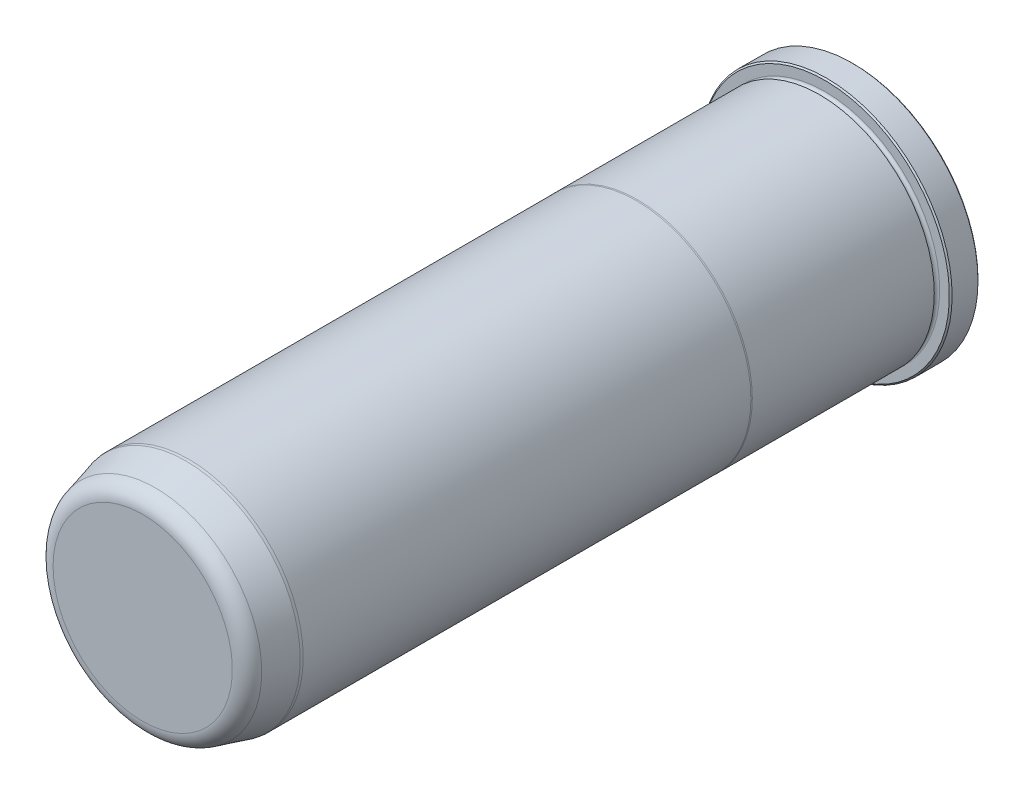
ISO-10303-21;
HEADER;
FILE_DESCRIPTION(('STEP AP214'),'2;1');
FILE_NAME('part.step','',(''),(''),'','','');
FILE_SCHEMA(('AUTOMOTIVE_DESIGN { 1 0 10303 214 1 1 1 1 }'));
ENDSEC;
DATA;
#1=APPLICATION_CONTEXT('core data for automotive mechanical design processes');
#2=APPLICATION_PROTOCOL_DEFINITION('international standard','automotive_design',2000,#1);
#3=PRODUCT_CONTEXT('',#1,'mechanical');
#4=PRODUCT('Part','Part','',(#3));
#5=PRODUCT_RELATED_PRODUCT_CATEGORY('part','',(#4));
#6=PRODUCT_DEFINITION_FORMATION('','',#4);
#7=PRODUCT_DEFINITION_CONTEXT('part definition',#1,'design');
#8=PRODUCT_DEFINITION('design','',#6,#7);
#9=PRODUCT_DEFINITION_SHAPE('','',#8);
#10=(LENGTH_UNIT() NAMED_UNIT(*) SI_UNIT(.MILLI.,.METRE.));
#11=(NAMED_UNIT(*) PLANE_ANGLE_UNIT() SI_UNIT($,.RADIAN.));
#12=(NAMED_UNIT(*) SI_UNIT($,.STERADIAN.) SOLID_ANGLE_UNIT());
#13=UNCERTAINTY_MEASURE_WITH_UNIT(LENGTH_MEASURE(1.E-05),#10,'distance_accuracy_value','');
#14=(GEOMETRIC_REPRESENTATION_CONTEXT(3) GLOBAL_UNCERTAINTY_ASSIGNED_CONTEXT((#13)) GLOBAL_UNIT_ASSIGNED_CONTEXT((#10,
#11,#12)) REPRESENTATION_CONTEXT('',''));
#15=CARTESIAN_POINT('',(0.,0.,0.));
#16=DIRECTION('',(0.,0.,1.));
#17=DIRECTION('',(1.,0.,0.));
#18=AXIS2_PLACEMENT_3D('',#15,#16,#17);
#19=CARTESIAN_POINT('',(0.,0.,0.));
#20=DIRECTION('',(0.,0.,1.));
#21=DIRECTION('',(1.,0.,0.));
#22=AXIS2_PLACEMENT_3D('',#19,#20,#21);
#23=PLANE('',#22);
#24=CARTESIAN_POINT('',(0.,0.,0.));
#25=DIRECTION('',(0.,0.,1.));
#26=DIRECTION('',(1.,0.,0.));
#27=AXIS2_PLACEMENT_3D('',#24,#25,#26);
#28=CIRCLE('',#27,34.417);
#29=CARTESIAN_POINT('',(34.417,0.,0.));
#30=VERTEX_POINT('',#29);
#31=EDGE_CURVE('E37',#30,#30,#28,.F.);
#32=ORIENTED_EDGE('',*,*,#31,.T.);
#33=EDGE_LOOP('',(#32));
#34=FACE_BOUND('',#33,.T.);
#35=ADVANCED_FACE('F30',(#34),#23,.F.);
#36=CARTESIAN_POINT('',(0.,0.,0.));
#37=DIRECTION('',(0.,0.,1.));
#38=DIRECTION('',(1.,0.,0.));
#39=AXIS2_PLACEMENT_3D('',#36,#37,#38);
#40=CYLINDRICAL_SURFACE('',#39,34.798);
#41=CARTESIAN_POINT('',(0.,0.,0.380999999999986));
#42=DIRECTION('',(0.,0.,1.));
#43=DIRECTION('',(1.,0.,0.));
#44=AXIS2_PLACEMENT_3D('',#41,#42,#43);
#45=CIRCLE('',#44,34.798);
#46=CARTESIAN_POINT('',(34.798,0.,0.380999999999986));
#47=VERTEX_POINT('',#46);
#48=EDGE_CURVE('E41',#47,#47,#45,.T.);
#49=ORIENTED_EDGE('',*,*,#48,.T.);
#50=EDGE_LOOP('',(#49));
#51=FACE_BOUND('',#50,.T.);
#52=CARTESIAN_POINT('',(0.,0.,7.5438));
#53=DIRECTION('',(0.,0.,-1.));
#54=DIRECTION('',(-1.,0.,0.));
#55=AXIS2_PLACEMENT_3D('',#52,#53,#54);
#56=CIRCLE('',#55,34.798);
#57=CARTESIAN_POINT('',(-34.798,0.,7.5438));
#58=VERTEX_POINT('',#57);
#59=EDGE_CURVE('E45',#58,#58,#56,.T.);
#60=ORIENTED_EDGE('',*,*,#59,.T.);
#61=EDGE_LOOP('',(#60));
#62=FACE_BOUND('',#61,.T.);
#63=ADVANCED_FACE('F118',(#51,#62),#40,.T.);
#64=CARTESIAN_POINT('',(0.,34.798,7.9248));
#65=DIRECTION('',(0.,0.,-1.));
#66=DIRECTION('',(-1.,0.,0.));
#67=AXIS2_PLACEMENT_3D('',#64,#65,#66);
#68=PLANE('',#67);
#69=CARTESIAN_POINT('',(0.,0.,7.9248));
#70=DIRECTION('',(0.,0.,-1.));
#71=DIRECTION('',(-1.,0.,0.));
#72=AXIS2_PLACEMENT_3D('',#69,#70,#71);
#73=CIRCLE('',#72,34.417);
#74=CARTESIAN_POINT('',(-34.417,0.,7.9248));
#75=VERTEX_POINT('',#74);
#76=EDGE_CURVE('E10',#75,#75,#73,.F.);
#77=ORIENTED_EDGE('',*,*,#76,.T.);
#78=EDGE_LOOP('',(#77));
#79=FACE_BOUND('',#78,.T.);
#80=CARTESIAN_POINT('',(0.,0.,7.9248));
#81=DIRECTION('',(0.,0.,1.));
#82=DIRECTION('',(1.,0.,0.));
#83=AXIS2_PLACEMENT_3D('',#80,#81,#82);
#84=CIRCLE('',#83,31.7373);
#85=CARTESIAN_POINT('',(31.7373,0.,7.9248));
#86=VERTEX_POINT('',#85);
#87=EDGE_CURVE('E56',#86,#86,#84,.T.);
#88=ORIENTED_EDGE('',*,*,#87,.F.);
#89=EDGE_LOOP('',(#88));
#90=FACE_BOUND('',#89,.T.);
#91=ADVANCED_FACE('F113',(#79,#90),#68,.F.);
#92=CARTESIAN_POINT('',(0.,0.,8.6868));
#93=DIRECTION('',(0.,0.,1.));
#94=DIRECTION('',(1.,0.,0.));
#95=AXIS2_PLACEMENT_3D('',#92,#93,#94);
#96=TOROIDAL_SURFACE('',#95,31.7373,0.761999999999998);
#97=CARTESIAN_POINT('',(0.,0.,9.44879999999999));
#98=DIRECTION('',(0.,0.,1.));
#99=DIRECTION('',(1.,0.,0.));
#100=AXIS2_PLACEMENT_3D('',#97,#98,#99);
#101=CIRCLE('',#100,31.7373);
#102=CARTESIAN_POINT('',(31.7373,0.,9.44879999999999));
#103=VERTEX_POINT('',#102);
#104=EDGE_CURVE('E59',#103,#103,#101,.T.);
#105=ORIENTED_EDGE('',*,*,#104,.F.);
#106=EDGE_LOOP('',(#105));
#107=FACE_BOUND('',#106,.T.);
#108=ORIENTED_EDGE('',*,*,#87,.T.);
#109=EDGE_LOOP('',(#108));
#110=FACE_BOUND('',#109,.T.);
#111=ADVANCED_FACE('F107',(#107,#110),#96,.F.);
#112=CARTESIAN_POINT('',(0.,31.7373,9.44879999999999));
#113=DIRECTION('',(0.,0.,1.));
#114=DIRECTION('',(1.,0.,0.));
#115=AXIS2_PLACEMENT_3D('',#112,#113,#114);
#116=PLANE('',#115);
#117=CARTESIAN_POINT('',(0.,0.,9.4488));
#118=DIRECTION('',(0.,0.,1.));
#119=DIRECTION('',(1.,0.,0.));
#120=AXIS2_PLACEMENT_3D('',#117,#118,#119);
#121=CIRCLE('',#120,31.7627);
#122=CARTESIAN_POINT('',(31.7627,0.,9.4488));
#123=VERTEX_POINT('',#122);
#124=EDGE_CURVE('E62',#123,#123,#121,.T.);
#125=ORIENTED_EDGE('',*,*,#124,.F.);
#126=EDGE_LOOP('',(#125));
#127=FACE_BOUND('',#126,.T.);
#128=ORIENTED_EDGE('',*,*,#104,.T.);
#129=EDGE_LOOP('',(#128));
#130=FACE_BOUND('',#129,.T.);
#131=ADVANCED_FACE('F101',(#127,#130),#116,.F.);
#132=CARTESIAN_POINT('',(0.,0.,0.));
#133=DIRECTION('',(0.,0.,1.));
#134=DIRECTION('',(1.,0.,0.));
#135=AXIS2_PLACEMENT_3D('',#132,#133,#134);
#136=CYLINDRICAL_SURFACE('',#135,31.7627);
#137=CARTESIAN_POINT('',(0.,0.,59.8347630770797));
#138=DIRECTION('',(0.,0.,1.));
#139=DIRECTION('',(1.,0.,0.));
#140=AXIS2_PLACEMENT_3D('',#137,#138,#139);
#141=CIRCLE('',#140,31.7627);
#142=CARTESIAN_POINT('',(31.7627,0.,59.8347630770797));
#143=VERTEX_POINT('',#142);
#144=EDGE_CURVE('E65',#143,#143,#141,.T.);
#145=ORIENTED_EDGE('',*,*,#144,.F.);
#146=EDGE_LOOP('',(#145));
#147=FACE_BOUND('',#146,.T.);
#148=ORIENTED_EDGE('',*,*,#124,.T.);
#149=EDGE_LOOP('',(#148));
#150=FACE_BOUND('',#149,.T.);
#151=ADVANCED_FACE('F95',(#147,#150),#136,.T.);
#152=CARTESIAN_POINT('',(0.,0.,59.8347630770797));
#153=DIRECTION('',(0.,0.,-1.));
#154=DIRECTION('',(-1.,0.,0.));
#155=AXIS2_PLACEMENT_3D('',#152,#153,#154);
#156=CONICAL_SURFACE('',#155,31.7627,0.0698131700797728);
#157=CARTESIAN_POINT('',(0.,0.,60.198));
#158=DIRECTION('',(0.,0.,1.));
#159=DIRECTION('',(1.,0.,0.));
#160=AXIS2_PLACEMENT_3D('',#157,#158,#159);
#161=CIRCLE('',#160,31.7373);
#162=CARTESIAN_POINT('',(31.7373,0.,60.198));
#163=VERTEX_POINT('',#162);
#164=EDGE_CURVE('E68',#163,#163,#161,.T.);
#165=ORIENTED_EDGE('',*,*,#164,.F.);
#166=EDGE_LOOP('',(#165));
#167=FACE_BOUND('',#166,.T.);
#168=ORIENTED_EDGE('',*,*,#144,.T.);
#169=EDGE_LOOP('',(#168));
#170=FACE_BOUND('',#169,.T.);
#171=ADVANCED_FACE('F89',(#167,#170),#156,.T.);
#172=CARTESIAN_POINT('',(0.,0.,0.));
#173=DIRECTION('',(0.,0.,1.));
#174=DIRECTION('',(1.,0.,0.));
#175=AXIS2_PLACEMENT_3D('',#172,#173,#174);
#176=CYLINDRICAL_SURFACE('',#175,31.7373);
#177=CARTESIAN_POINT('',(0.,0.,184.15));
#178=DIRECTION('',(0.,0.,1.));
#179=DIRECTION('',(1.,0.,0.));
#180=AXIS2_PLACEMENT_3D('',#177,#178,#179);
#181=CIRCLE('',#180,31.7373);
#182=CARTESIAN_POINT('',(31.7373,0.,184.15));
#183=VERTEX_POINT('',#182);
#184=EDGE_CURVE('E71',#183,#183,#181,.T.);
#185=ORIENTED_EDGE('',*,*,#184,.F.);
#186=EDGE_LOOP('',(#185));
#187=FACE_BOUND('',#186,.T.);
#188=ORIENTED_EDGE('',*,*,#164,.T.);
#189=EDGE_LOOP('',(#188));
#190=FACE_BOUND('',#189,.T.);
#191=ADVANCED_FACE('F83',(#187,#190),#176,.T.);
#192=CARTESIAN_POINT('',(0.,0.,184.15));
#193=DIRECTION('',(0.,0.,-1.));
#194=DIRECTION('',(-1.,0.,0.));
#195=AXIS2_PLACEMENT_3D('',#192,#193,#194);
#196=CONICAL_SURFACE('',#195,31.7373,0.0872664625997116);
#197=CARTESIAN_POINT('',(0.,0.,184.912));
#198=DIRECTION('',(0.,0.,1.));
#199=DIRECTION('',(1.,0.,0.));
#200=AXIS2_PLACEMENT_3D('',#197,#198,#199);
#201=CIRCLE('',#200,31.6706336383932);
#202=CARTESIAN_POINT('',(31.6706336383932,0.,184.912));
#203=VERTEX_POINT('',#202);
#204=EDGE_CURVE('E74',#203,#203,#201,.T.);
#205=ORIENTED_EDGE('',*,*,#204,.F.);
#206=EDGE_LOOP('',(#205));
#207=FACE_BOUND('',#206,.T.);
#208=ORIENTED_EDGE('',*,*,#184,.T.);
#209=EDGE_LOOP('',(#208));
#210=FACE_BOUND('',#209,.T.);
#211=ADVANCED_FACE('F80',(#207,#210),#196,.T.);
#212=CARTESIAN_POINT('',(0.,0.,184.912));
#213=DIRECTION('',(0.,0.,-1.));
#214=DIRECTION('',(-1.,0.,0.));
#215=AXIS2_PLACEMENT_3D('',#212,#213,#214);
#216=CONICAL_SURFACE('',#215,31.6706336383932,0.26179938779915);
#217=CARTESIAN_POINT('',(0.,0.,193.320125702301));
#218=DIRECTION('',(0.,0.,1.));
#219=DIRECTION('',(1.,0.,0.));
#220=AXIS2_PLACEMENT_3D('',#217,#218,#219);
#221=CIRCLE('',#220,29.4176831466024);
#222=CARTESIAN_POINT('',(29.4176831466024,0.,193.320125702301));
#223=VERTEX_POINT('',#222);
#224=EDGE_CURVE('E50',#223,#223,#221,.F.);
#225=ORIENTED_EDGE('',*,*,#224,.T.);
#226=EDGE_LOOP('',(#225));
#227=FACE_BOUND('',#226,.T.);
#228=ORIENTED_EDGE('',*,*,#204,.T.);
#229=EDGE_LOOP('',(#228));
#230=FACE_BOUND('',#229,.T.);
#231=ADVANCED_FACE('F78',(#227,#230),#216,.T.);
#232=CARTESIAN_POINT('',(0.,28.4718561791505,196.85));
#233=DIRECTION('',(0.,0.,-1.));
#234=DIRECTION('',(-1.,0.,0.));
#235=AXIS2_PLACEMENT_3D('',#232,#233,#234);
#236=PLANE('',#235);
#237=CARTESIAN_POINT('',(0.,0.,196.85));
#238=DIRECTION('',(0.,0.,-1.));
#239=DIRECTION('',(-1.,0.,0.));
#240=AXIS2_PLACEMENT_3D('',#237,#238,#239);
#241=CIRCLE('',#240,24.8174613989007);
#242=CARTESIAN_POINT('',(-24.8174613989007,0.,196.85));
#243=VERTEX_POINT('',#242);
#244=EDGE_CURVE('E53',#243,#243,#241,.F.);
#245=ORIENTED_EDGE('',*,*,#244,.T.);
#246=EDGE_LOOP('',(#245));
#247=FACE_BOUND('',#246,.T.);
#248=ADVANCED_FACE('F133',(#247),#236,.F.);
#249=CARTESIAN_POINT('',(0.,0.,192.0875));
#250=DIRECTION('',(0.,0.,-1.));
#251=DIRECTION('',(-1.,0.,0.));
#252=AXIS2_PLACEMENT_3D('',#249,#250,#251);
#253=TOROIDAL_SURFACE('',#252,24.8174613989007,4.7625);
#254=ORIENTED_EDGE('',*,*,#224,.F.);
#255=EDGE_LOOP('',(#254));
#256=FACE_BOUND('',#255,.T.);
#257=ORIENTED_EDGE('',*,*,#244,.F.);
#258=EDGE_LOOP('',(#257));
#259=FACE_BOUND('',#258,.T.);
#260=ADVANCED_FACE('F130',(#256,#259),#253,.T.);
#261=CARTESIAN_POINT('',(0.,0.,0.380999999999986));
#262=DIRECTION('',(0.,0.,1.));
#263=DIRECTION('',(1.,0.,0.));
#264=AXIS2_PLACEMENT_3D('',#261,#262,#263);
#265=CONICAL_SURFACE('',#264,34.798,0.785398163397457);
#266=ORIENTED_EDGE('',*,*,#31,.F.);
#267=EDGE_LOOP('',(#266));
#268=FACE_BOUND('',#267,.T.);
#269=ORIENTED_EDGE('',*,*,#48,.F.);
#270=EDGE_LOOP('',(#269));
#271=FACE_BOUND('',#270,.T.);
#272=ADVANCED_FACE('F132',(#268,#271),#265,.T.);
#273=CARTESIAN_POINT('',(0.,0.,7.9248));
#274=DIRECTION('',(0.,0.,-1.));
#275=DIRECTION('',(-1.,0.,0.));
#276=AXIS2_PLACEMENT_3D('',#273,#274,#275);
#277=CONICAL_SURFACE('',#276,34.417,0.785398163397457);
#278=ORIENTED_EDGE('',*,*,#59,.F.);
#279=EDGE_LOOP('',(#278));
#280=FACE_BOUND('',#279,.T.);
#281=ORIENTED_EDGE('',*,*,#76,.F.);
#282=EDGE_LOOP('',(#281));
#283=FACE_BOUND('',#282,.T.);
#284=ADVANCED_FACE('F32',(#280,#283),#277,.T.);
#285=CLOSED_SHELL('',(#35,#63,#91,#111,#131,#151,#171,#191,#211,#231,#248,#260,#272,#284));
#286=MANIFOLD_SOLID_BREP('B2',#285);
#287=ADVANCED_BREP_SHAPE_REPRESENTATION('',(#18,#286),#14);
#288=SHAPE_DEFINITION_REPRESENTATION(#9,#287);
ENDSEC;
END-ISO-10303-21;
